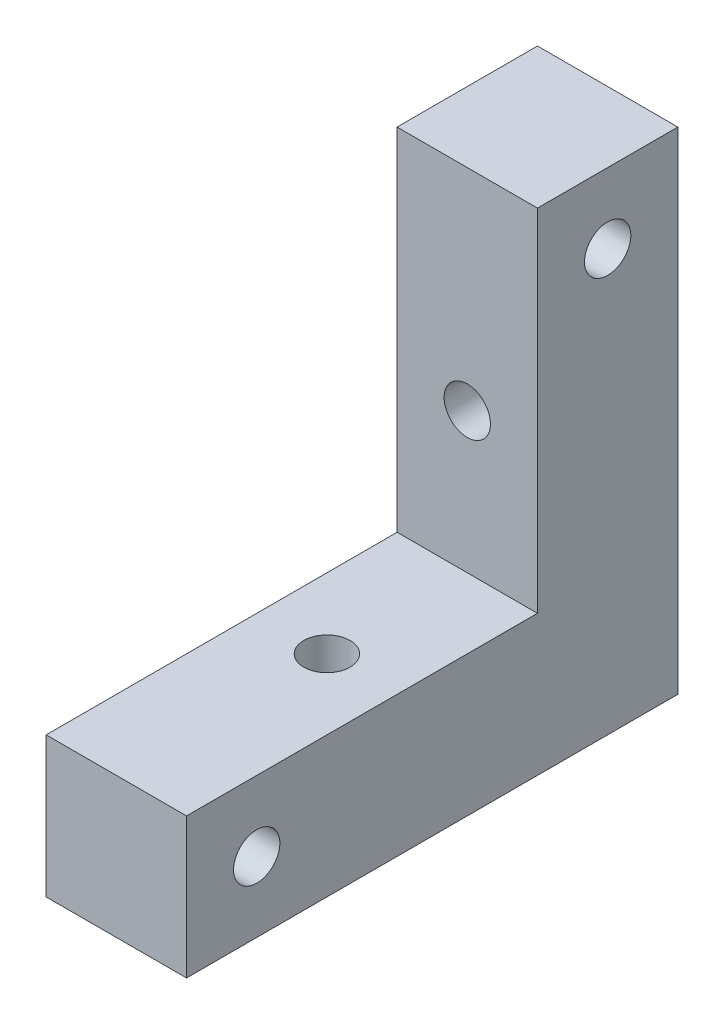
ISO-10303-21;
HEADER;
FILE_DESCRIPTION(('STEP AP214'),'2;1');
FILE_NAME('part.step','',(''),(''),'','','');
FILE_SCHEMA(('AUTOMOTIVE_DESIGN { 1 0 10303 214 1 1 1 1 }'));
ENDSEC;
DATA;
#1=APPLICATION_CONTEXT('core data for automotive mechanical design processes');
#2=APPLICATION_PROTOCOL_DEFINITION('international standard','automotive_design',2000,#1);
#3=PRODUCT_CONTEXT('',#1,'mechanical');
#4=PRODUCT('Part','Part','',(#3));
#5=PRODUCT_RELATED_PRODUCT_CATEGORY('part','',(#4));
#6=PRODUCT_DEFINITION_FORMATION('','',#4);
#7=PRODUCT_DEFINITION_CONTEXT('part definition',#1,'design');
#8=PRODUCT_DEFINITION('design','',#6,#7);
#9=PRODUCT_DEFINITION_SHAPE('','',#8);
#10=(LENGTH_UNIT() NAMED_UNIT(*) SI_UNIT(.MILLI.,.METRE.));
#11=(NAMED_UNIT(*) PLANE_ANGLE_UNIT() SI_UNIT($,.RADIAN.));
#12=(NAMED_UNIT(*) SI_UNIT($,.STERADIAN.) SOLID_ANGLE_UNIT());
#13=UNCERTAINTY_MEASURE_WITH_UNIT(LENGTH_MEASURE(1.E-05),#10,'distance_accuracy_value','');
#14=(GEOMETRIC_REPRESENTATION_CONTEXT(3) GLOBAL_UNCERTAINTY_ASSIGNED_CONTEXT((#13)) GLOBAL_UNIT_ASSIGNED_CONTEXT((#10,
#11,#12)) REPRESENTATION_CONTEXT('',''));
#15=CARTESIAN_POINT('',(0.,0.,0.));
#16=DIRECTION('',(0.,0.,1.));
#17=DIRECTION('',(1.,0.,0.));
#18=AXIS2_PLACEMENT_3D('',#15,#16,#17);
#19=CARTESIAN_POINT('',(-5.,-5.,35.));
#20=DIRECTION('',(0.,1.,0.));
#21=DIRECTION('',(0.,0.,1.));
#22=AXIS2_PLACEMENT_3D('',#19,#20,#21);
#23=PLANE('',#22);
#24=DIRECTION('',(1.,0.,0.));
#25=VECTOR('',#24,1.);
#26=CARTESIAN_POINT('',(-5.,-5.,0.));
#27=LINE('',#26,#25);
#28=CARTESIAN_POINT('',(-5.,-5.,0.));
#29=VERTEX_POINT('',#28);
#30=CARTESIAN_POINT('',(5.,-5.,0.));
#31=VERTEX_POINT('',#30);
#32=EDGE_CURVE('E79',#29,#31,#27,.T.);
#33=ORIENTED_EDGE('',*,*,#32,.T.);
#34=DIRECTION('',(0.,0.,-1.));
#35=VECTOR('',#34,1.);
#36=CARTESIAN_POINT('',(5.,-5.,35.));
#37=LINE('',#36,#35);
#38=CARTESIAN_POINT('',(5.,-5.,35.));
#39=VERTEX_POINT('',#38);
#40=EDGE_CURVE('E135',#39,#31,#37,.T.);
#41=ORIENTED_EDGE('',*,*,#40,.F.);
#42=DIRECTION('',(1.,0.,0.));
#43=VECTOR('',#42,1.);
#44=CARTESIAN_POINT('',(-5.,-5.,35.));
#45=LINE('',#44,#43);
#46=CARTESIAN_POINT('',(-5.,-5.,35.));
#47=VERTEX_POINT('',#46);
#48=EDGE_CURVE('E64',#47,#39,#45,.T.);
#49=ORIENTED_EDGE('',*,*,#48,.F.);
#50=DIRECTION('',(0.,0.,-1.));
#51=VECTOR('',#50,1.);
#52=CARTESIAN_POINT('',(-5.,-5.,35.));
#53=LINE('',#52,#51);
#54=EDGE_CURVE('E140',#47,#29,#53,.T.);
#55=ORIENTED_EDGE('',*,*,#54,.T.);
#56=EDGE_LOOP('',(#33,#41,#49,#55));
#57=FACE_BOUND('',#56,.T.);
#58=CARTESIAN_POINT('',(0.,-5.,20.));
#59=DIRECTION('',(0.,-1.,0.));
#60=DIRECTION('',(0.,0.,-1.));
#61=AXIS2_PLACEMENT_3D('',#58,#59,#60);
#62=CIRCLE('',#61,1.64999999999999);
#63=CARTESIAN_POINT('',(0.,-5.,18.35));
#64=VERTEX_POINT('',#63);
#65=EDGE_CURVE('E162',#64,#64,#62,.T.);
#66=ORIENTED_EDGE('',*,*,#65,.F.);
#67=EDGE_LOOP('',(#66));
#68=FACE_BOUND('',#67,.T.);
#69=ADVANCED_FACE('F41',(#57,#68),#23,.F.);
#70=CARTESIAN_POINT('',(-5.,5.,35.));
#71=DIRECTION('',(0.,-1.,0.));
#72=DIRECTION('',(0.,0.,-1.));
#73=AXIS2_PLACEMENT_3D('',#70,#71,#72);
#74=PLANE('',#73);
#75=CARTESIAN_POINT('',(0.,5.,20.));
#76=DIRECTION('',(0.,-1.,0.));
#77=DIRECTION('',(0.,0.,-1.));
#78=AXIS2_PLACEMENT_3D('',#75,#76,#77);
#79=CIRCLE('',#78,1.64999999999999);
#80=CARTESIAN_POINT('',(0.,5.,18.35));
#81=VERTEX_POINT('',#80);
#82=EDGE_CURVE('E157',#81,#81,#79,.T.);
#83=ORIENTED_EDGE('',*,*,#82,.T.);
#84=EDGE_LOOP('',(#83));
#85=FACE_BOUND('',#84,.T.);
#86=DIRECTION('',(1.,0.,0.));
#87=VECTOR('',#86,1.);
#88=CARTESIAN_POINT('',(-5.,5.,10.));
#89=LINE('',#88,#87);
#90=CARTESIAN_POINT('',(-5.,5.,10.));
#91=VERTEX_POINT('',#90);
#92=CARTESIAN_POINT('',(5.,5.,10.));
#93=VERTEX_POINT('',#92);
#94=EDGE_CURVE('E55',#91,#93,#89,.T.);
#95=ORIENTED_EDGE('',*,*,#94,.F.);
#96=DIRECTION('',(0.,0.,-1.));
#97=VECTOR('',#96,1.);
#98=CARTESIAN_POINT('',(-5.,5.,35.));
#99=LINE('',#98,#97);
#100=CARTESIAN_POINT('',(-5.,5.,35.));
#101=VERTEX_POINT('',#100);
#102=EDGE_CURVE('E49',#101,#91,#99,.T.);
#103=ORIENTED_EDGE('',*,*,#102,.F.);
#104=DIRECTION('',(-1.,0.,0.));
#105=VECTOR('',#104,1.);
#106=CARTESIAN_POINT('',(-5.,5.,35.));
#107=LINE('',#106,#105);
#108=CARTESIAN_POINT('',(5.,5.,35.));
#109=VERTEX_POINT('',#108);
#110=EDGE_CURVE('E84',#109,#101,#107,.T.);
#111=ORIENTED_EDGE('',*,*,#110,.F.);
#112=DIRECTION('',(0.,0.,-1.));
#113=VECTOR('',#112,1.);
#114=CARTESIAN_POINT('',(5.,5.,35.));
#115=LINE('',#114,#113);
#116=EDGE_CURVE('E11',#109,#93,#115,.T.);
#117=ORIENTED_EDGE('',*,*,#116,.T.);
#118=EDGE_LOOP('',(#95,#103,#111,#117));
#119=FACE_BOUND('',#118,.T.);
#120=ADVANCED_FACE('F202',(#85,#119),#74,.F.);
#121=CARTESIAN_POINT('',(5.,5.,35.));
#122=DIRECTION('',(-1.,0.,0.));
#123=DIRECTION('',(0.,0.,1.));
#124=AXIS2_PLACEMENT_3D('',#121,#122,#123);
#125=PLANE('',#124);
#126=CARTESIAN_POINT('',(4.99999999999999,25.,5.));
#127=DIRECTION('',(-1.,0.,0.));
#128=DIRECTION('',(0.,0.,1.));
#129=AXIS2_PLACEMENT_3D('',#126,#127,#128);
#130=CIRCLE('',#129,1.64999999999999);
#131=CARTESIAN_POINT('',(4.99999999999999,25.,6.64999999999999));
#132=VERTEX_POINT('',#131);
#133=EDGE_CURVE('E171',#132,#132,#130,.T.);
#134=ORIENTED_EDGE('',*,*,#133,.T.);
#135=EDGE_LOOP('',(#134));
#136=FACE_BOUND('',#135,.T.);
#137=CARTESIAN_POINT('',(5.,0.,30.));
#138=DIRECTION('',(-1.,0.,0.));
#139=DIRECTION('',(0.,0.,1.));
#140=AXIS2_PLACEMENT_3D('',#137,#138,#139);
#141=CIRCLE('',#140,1.64999999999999);
#142=CARTESIAN_POINT('',(5.,0.,31.65));
#143=VERTEX_POINT('',#142);
#144=EDGE_CURVE('E165',#143,#143,#141,.T.);
#145=ORIENTED_EDGE('',*,*,#144,.T.);
#146=EDGE_LOOP('',(#145));
#147=FACE_BOUND('',#146,.T.);
#148=DIRECTION('',(0.,1.,0.));
#149=VECTOR('',#148,1.);
#150=CARTESIAN_POINT('',(5.,5.,0.));
#151=LINE('',#150,#149);
#152=CARTESIAN_POINT('',(5.,30.,0.));
#153=VERTEX_POINT('',#152);
#154=EDGE_CURVE('E123',#31,#153,#151,.T.);
#155=ORIENTED_EDGE('',*,*,#154,.T.);
#156=DIRECTION('',(0.,0.,-1.));
#157=VECTOR('',#156,1.);
#158=CARTESIAN_POINT('',(5.,30.,0.));
#159=LINE('',#158,#157);
#160=CARTESIAN_POINT('',(5.,30.,10.));
#161=VERTEX_POINT('',#160);
#162=EDGE_CURVE('E111',#161,#153,#159,.T.);
#163=ORIENTED_EDGE('',*,*,#162,.F.);
#164=DIRECTION('',(0.,-1.,0.));
#165=VECTOR('',#164,1.);
#166=CARTESIAN_POINT('',(5.,30.,10.));
#167=LINE('',#166,#165);
#168=EDGE_CURVE('E107',#161,#93,#167,.T.);
#169=ORIENTED_EDGE('',*,*,#168,.T.);
#170=ORIENTED_EDGE('',*,*,#116,.F.);
#171=DIRECTION('',(0.,1.,0.));
#172=VECTOR('',#171,1.);
#173=CARTESIAN_POINT('',(5.,5.,35.));
#174=LINE('',#173,#172);
#175=EDGE_CURVE('E130',#39,#109,#174,.T.);
#176=ORIENTED_EDGE('',*,*,#175,.F.);
#177=ORIENTED_EDGE('',*,*,#40,.T.);
#178=EDGE_LOOP('',(#155,#163,#169,#170,#176,#177));
#179=FACE_BOUND('',#178,.T.);
#180=ADVANCED_FACE('F43',(#136,#147,#179),#125,.F.);
#181=CARTESIAN_POINT('',(-5.,5.,35.));
#182=DIRECTION('',(1.,0.,0.));
#183=DIRECTION('',(0.,1.,0.));
#184=AXIS2_PLACEMENT_3D('',#181,#182,#183);
#185=PLANE('',#184);
#186=CARTESIAN_POINT('',(-5.,25.,5.));
#187=DIRECTION('',(-1.,0.,0.));
#188=DIRECTION('',(0.,0.,1.));
#189=AXIS2_PLACEMENT_3D('',#186,#187,#188);
#190=CIRCLE('',#189,1.64999999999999);
#191=CARTESIAN_POINT('',(-5.,25.,6.64999999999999));
#192=VERTEX_POINT('',#191);
#193=EDGE_CURVE('E174',#192,#192,#190,.T.);
#194=ORIENTED_EDGE('',*,*,#193,.F.);
#195=EDGE_LOOP('',(#194));
#196=FACE_BOUND('',#195,.T.);
#197=CARTESIAN_POINT('',(-5.,0.,30.));
#198=DIRECTION('',(-1.,0.,0.));
#199=DIRECTION('',(0.,0.,1.));
#200=AXIS2_PLACEMENT_3D('',#197,#198,#199);
#201=CIRCLE('',#200,1.64999999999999);
#202=CARTESIAN_POINT('',(-5.,0.,31.65));
#203=VERTEX_POINT('',#202);
#204=EDGE_CURVE('E168',#203,#203,#201,.T.);
#205=ORIENTED_EDGE('',*,*,#204,.F.);
#206=EDGE_LOOP('',(#205));
#207=FACE_BOUND('',#206,.T.);
#208=DIRECTION('',(0.,-1.,0.));
#209=VECTOR('',#208,1.);
#210=CARTESIAN_POINT('',(-5.,5.,0.));
#211=LINE('',#210,#209);
#212=CARTESIAN_POINT('',(-5.,30.,0.));
#213=VERTEX_POINT('',#212);
#214=EDGE_CURVE('E125',#213,#29,#211,.T.);
#215=ORIENTED_EDGE('',*,*,#214,.T.);
#216=ORIENTED_EDGE('',*,*,#54,.F.);
#217=DIRECTION('',(0.,-1.,0.));
#218=VECTOR('',#217,1.);
#219=CARTESIAN_POINT('',(-5.,5.,35.));
#220=LINE('',#219,#218);
#221=EDGE_CURVE('E133',#101,#47,#220,.T.);
#222=ORIENTED_EDGE('',*,*,#221,.F.);
#223=ORIENTED_EDGE('',*,*,#102,.T.);
#224=DIRECTION('',(0.,-1.,0.));
#225=VECTOR('',#224,1.);
#226=CARTESIAN_POINT('',(-5.,30.,10.));
#227=LINE('',#226,#225);
#228=CARTESIAN_POINT('',(-5.,30.,10.));
#229=VERTEX_POINT('',#228);
#230=EDGE_CURVE('E105',#229,#91,#227,.T.);
#231=ORIENTED_EDGE('',*,*,#230,.F.);
#232=DIRECTION('',(0.,0.,1.));
#233=VECTOR('',#232,1.);
#234=CARTESIAN_POINT('',(-5.,30.,0.));
#235=LINE('',#234,#233);
#236=EDGE_CURVE('E112',#213,#229,#235,.T.);
#237=ORIENTED_EDGE('',*,*,#236,.F.);
#238=EDGE_LOOP('',(#215,#216,#222,#223,#231,#237));
#239=FACE_BOUND('',#238,.T.);
#240=ADVANCED_FACE('F121',(#196,#207,#239),#185,.F.);
#241=CARTESIAN_POINT('',(0.,0.,35.));
#242=DIRECTION('',(0.,0.,1.));
#243=DIRECTION('',(1.,0.,0.));
#244=AXIS2_PLACEMENT_3D('',#241,#242,#243);
#245=PLANE('',#244);
#246=ORIENTED_EDGE('',*,*,#175,.T.);
#247=ORIENTED_EDGE('',*,*,#110,.T.);
#248=ORIENTED_EDGE('',*,*,#221,.T.);
#249=ORIENTED_EDGE('',*,*,#48,.T.);
#250=EDGE_LOOP('',(#246,#247,#248,#249));
#251=FACE_BOUND('',#250,.T.);
#252=ADVANCED_FACE('F182',(#251),#245,.T.);
#253=CARTESIAN_POINT('',(0.,0.,0.));
#254=DIRECTION('',(0.,0.,1.));
#255=DIRECTION('',(1.,0.,0.));
#256=AXIS2_PLACEMENT_3D('',#253,#254,#255);
#257=PLANE('',#256);
#258=CARTESIAN_POINT('',(0.,15.,0.));
#259=DIRECTION('',(0.,0.,-1.));
#260=DIRECTION('',(-1.,0.,0.));
#261=AXIS2_PLACEMENT_3D('',#258,#259,#260);
#262=CIRCLE('',#261,1.64999999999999);
#263=CARTESIAN_POINT('',(-1.64999999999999,15.,0.));
#264=VERTEX_POINT('',#263);
#265=EDGE_CURVE('E152',#264,#264,#262,.T.);
#266=ORIENTED_EDGE('',*,*,#265,.F.);
#267=EDGE_LOOP('',(#266));
#268=FACE_BOUND('',#267,.T.);
#269=ORIENTED_EDGE('',*,*,#154,.F.);
#270=ORIENTED_EDGE('',*,*,#32,.F.);
#271=ORIENTED_EDGE('',*,*,#214,.F.);
#272=DIRECTION('',(-1.,0.,0.));
#273=VECTOR('',#272,1.);
#274=CARTESIAN_POINT('',(-5.,30.,0.));
#275=LINE('',#274,#273);
#276=EDGE_CURVE('E118',#153,#213,#275,.T.);
#277=ORIENTED_EDGE('',*,*,#276,.F.);
#278=EDGE_LOOP('',(#269,#270,#271,#277));
#279=FACE_BOUND('',#278,.T.);
#280=ADVANCED_FACE('F145',(#268,#279),#257,.F.);
#281=CARTESIAN_POINT('',(-5.,30.,10.));
#282=DIRECTION('',(0.,0.,-1.));
#283=DIRECTION('',(-1.,0.,0.));
#284=AXIS2_PLACEMENT_3D('',#281,#282,#283);
#285=PLANE('',#284);
#286=CARTESIAN_POINT('',(0.,15.,10.));
#287=DIRECTION('',(0.,0.,-1.));
#288=DIRECTION('',(-1.,0.,0.));
#289=AXIS2_PLACEMENT_3D('',#286,#287,#288);
#290=CIRCLE('',#289,1.64999999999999);
#291=CARTESIAN_POINT('',(-1.64999999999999,15.,10.));
#292=VERTEX_POINT('',#291);
#293=EDGE_CURVE('E150',#292,#292,#290,.T.);
#294=ORIENTED_EDGE('',*,*,#293,.T.);
#295=EDGE_LOOP('',(#294));
#296=FACE_BOUND('',#295,.T.);
#297=ORIENTED_EDGE('',*,*,#94,.T.);
#298=ORIENTED_EDGE('',*,*,#168,.F.);
#299=DIRECTION('',(1.,0.,0.));
#300=VECTOR('',#299,1.);
#301=CARTESIAN_POINT('',(-5.,30.,10.));
#302=LINE('',#301,#300);
#303=EDGE_CURVE('E101',#229,#161,#302,.T.);
#304=ORIENTED_EDGE('',*,*,#303,.F.);
#305=ORIENTED_EDGE('',*,*,#230,.T.);
#306=EDGE_LOOP('',(#297,#298,#304,#305));
#307=FACE_BOUND('',#306,.T.);
#308=ADVANCED_FACE('F103',(#296,#307),#285,.F.);
#309=CARTESIAN_POINT('',(0.,30.,0.));
#310=DIRECTION('',(0.,1.,0.));
#311=DIRECTION('',(0.,0.,1.));
#312=AXIS2_PLACEMENT_3D('',#309,#310,#311);
#313=PLANE('',#312);
#314=ORIENTED_EDGE('',*,*,#236,.T.);
#315=ORIENTED_EDGE('',*,*,#303,.T.);
#316=ORIENTED_EDGE('',*,*,#162,.T.);
#317=ORIENTED_EDGE('',*,*,#276,.T.);
#318=EDGE_LOOP('',(#314,#315,#316,#317));
#319=FACE_BOUND('',#318,.T.);
#320=ADVANCED_FACE('F116',(#319),#313,.T.);
#321=CARTESIAN_POINT('',(0.,15.,0.));
#322=DIRECTION('',(0.,0.,-1.));
#323=DIRECTION('',(-1.,0.,0.));
#324=AXIS2_PLACEMENT_3D('',#321,#322,#323);
#325=CYLINDRICAL_SURFACE('',#324,1.64999999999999);
#326=ORIENTED_EDGE('',*,*,#265,.T.);
#327=EDGE_LOOP('',(#326));
#328=FACE_BOUND('',#327,.T.);
#329=ORIENTED_EDGE('',*,*,#293,.F.);
#330=EDGE_LOOP('',(#329));
#331=FACE_BOUND('',#330,.T.);
#332=ADVANCED_FACE('F197',(#328,#331),#325,.F.);
#333=CARTESIAN_POINT('',(0.,-5.,20.));
#334=DIRECTION('',(0.,-1.,0.));
#335=DIRECTION('',(0.,0.,-1.));
#336=AXIS2_PLACEMENT_3D('',#333,#334,#335);
#337=CYLINDRICAL_SURFACE('',#336,1.64999999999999);
#338=ORIENTED_EDGE('',*,*,#65,.T.);
#339=EDGE_LOOP('',(#338));
#340=FACE_BOUND('',#339,.T.);
#341=ORIENTED_EDGE('',*,*,#82,.F.);
#342=EDGE_LOOP('',(#341));
#343=FACE_BOUND('',#342,.T.);
#344=ADVANCED_FACE('F188',(#340,#343),#337,.F.);
#345=CARTESIAN_POINT('',(-5.,0.,30.));
#346=DIRECTION('',(-1.,0.,0.));
#347=DIRECTION('',(0.,0.,1.));
#348=AXIS2_PLACEMENT_3D('',#345,#346,#347);
#349=CYLINDRICAL_SURFACE('',#348,1.64999999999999);
#350=ORIENTED_EDGE('',*,*,#144,.F.);
#351=EDGE_LOOP('',(#350));
#352=FACE_BOUND('',#351,.T.);
#353=ORIENTED_EDGE('',*,*,#204,.T.);
#354=EDGE_LOOP('',(#353));
#355=FACE_BOUND('',#354,.T.);
#356=ADVANCED_FACE('F186',(#352,#355),#349,.F.);
#357=CARTESIAN_POINT('',(-5.,25.,5.));
#358=DIRECTION('',(-1.,0.,0.));
#359=DIRECTION('',(0.,0.,1.));
#360=AXIS2_PLACEMENT_3D('',#357,#358,#359);
#361=CYLINDRICAL_SURFACE('',#360,1.64999999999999);
#362=ORIENTED_EDGE('',*,*,#133,.F.);
#363=EDGE_LOOP('',(#362));
#364=FACE_BOUND('',#363,.T.);
#365=ORIENTED_EDGE('',*,*,#193,.T.);
#366=EDGE_LOOP('',(#365));
#367=FACE_BOUND('',#366,.T.);
#368=ADVANCED_FACE('F178',(#364,#367),#361,.F.);
#369=CLOSED_SHELL('',(#69,#120,#180,#240,#252,#280,#308,#320,#332,#344,#356,#368));
#370=MANIFOLD_SOLID_BREP('B2',#369);
#371=ADVANCED_BREP_SHAPE_REPRESENTATION('',(#18,#370),#14);
#372=SHAPE_DEFINITION_REPRESENTATION(#9,#371);
ENDSEC;
END-ISO-10303-21;
